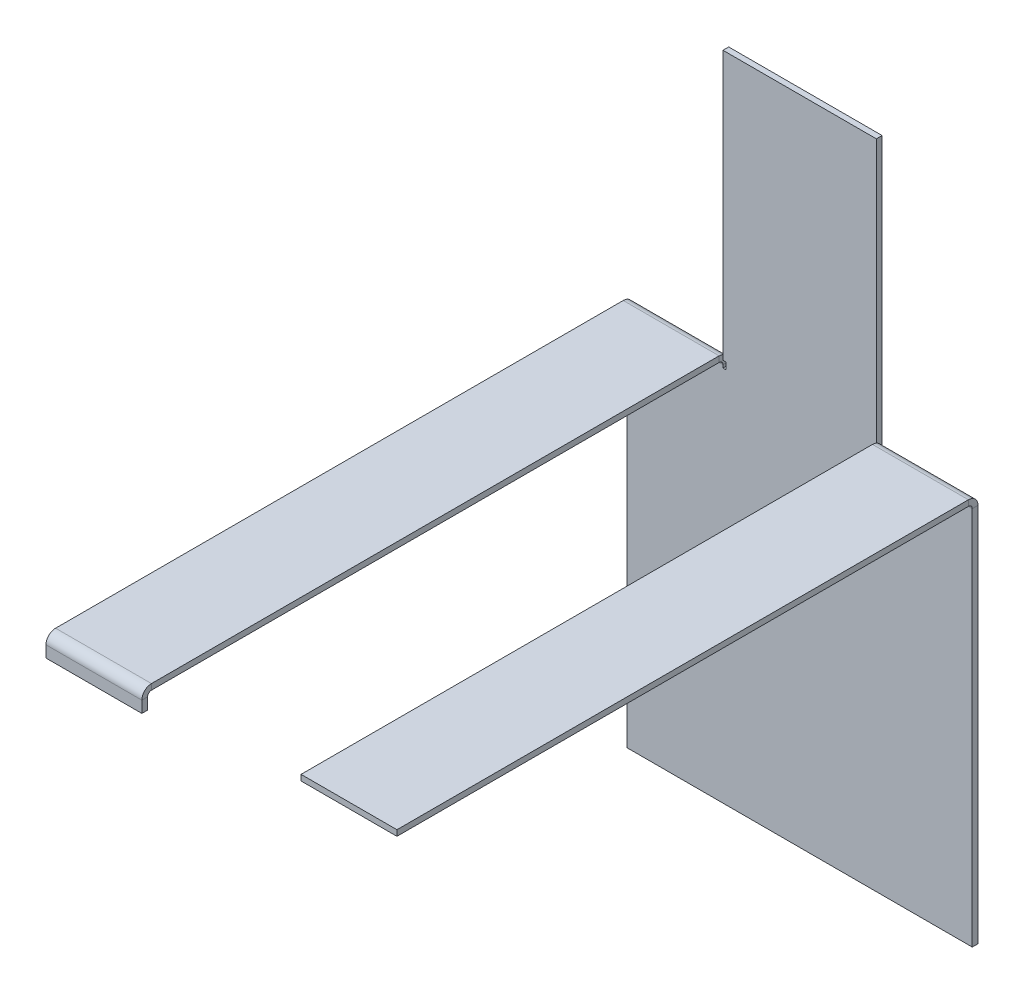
ISO-10303-21;
HEADER;
FILE_DESCRIPTION(('STEP AP214'),'2;1');
FILE_NAME('part.step','',(''),(''),'','','');
FILE_SCHEMA(('AUTOMOTIVE_DESIGN { 1 0 10303 214 1 1 1 1 }'));
ENDSEC;
DATA;
#1=APPLICATION_CONTEXT('core data for automotive mechanical design processes');
#2=APPLICATION_PROTOCOL_DEFINITION('international standard','automotive_design',2000,#1);
#3=PRODUCT_CONTEXT('',#1,'mechanical');
#4=PRODUCT('Part','Part','',(#3));
#5=PRODUCT_RELATED_PRODUCT_CATEGORY('part','',(#4));
#6=PRODUCT_DEFINITION_FORMATION('','',#4);
#7=PRODUCT_DEFINITION_CONTEXT('part definition',#1,'design');
#8=PRODUCT_DEFINITION('design','',#6,#7);
#9=PRODUCT_DEFINITION_SHAPE('','',#8);
#10=(LENGTH_UNIT() NAMED_UNIT(*) SI_UNIT(.MILLI.,.METRE.));
#11=(NAMED_UNIT(*) PLANE_ANGLE_UNIT() SI_UNIT($,.RADIAN.));
#12=(NAMED_UNIT(*) SI_UNIT($,.STERADIAN.) SOLID_ANGLE_UNIT());
#13=UNCERTAINTY_MEASURE_WITH_UNIT(LENGTH_MEASURE(1.E-05),#10,'distance_accuracy_value','');
#14=(GEOMETRIC_REPRESENTATION_CONTEXT(3) GLOBAL_UNCERTAINTY_ASSIGNED_CONTEXT((#13)) GLOBAL_UNIT_ASSIGNED_CONTEXT((#10,
#11,#12)) REPRESENTATION_CONTEXT('',''));
#15=CARTESIAN_POINT('',(0.,0.,0.));
#16=DIRECTION('',(0.,0.,1.));
#17=DIRECTION('',(1.,0.,0.));
#18=AXIS2_PLACEMENT_3D('',#15,#16,#17);
#19=CARTESIAN_POINT('',(-40.,3.,-150.));
#20=DIRECTION('',(-1.,0.,0.));
#21=DIRECTION('',(0.,-1.,0.));
#22=AXIS2_PLACEMENT_3D('',#19,#20,#21);
#23=PLANE('',#22);
#24=DIRECTION('',(0.,1.,0.));
#25=VECTOR('',#24,1.);
#26=CARTESIAN_POINT('',(-40.,1.0547118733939E-12,148.));
#27=LINE('',#26,#25);
#28=CARTESIAN_POINT('',(-40.,1.0547118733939E-12,148.));
#29=VERTEX_POINT('',#28);
#30=CARTESIAN_POINT('',(-40.,3.00000000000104,148.));
#31=VERTEX_POINT('',#30);
#32=EDGE_CURVE('E285',#29,#31,#27,.T.);
#33=ORIENTED_EDGE('',*,*,#32,.F.);
#34=DIRECTION('',(0.,0.,-1.));
#35=VECTOR('',#34,1.);
#36=CARTESIAN_POINT('',(-40.,0.,-150.));
#37=LINE('',#36,#35);
#38=CARTESIAN_POINT('',(-40.,0.,-148.));
#39=VERTEX_POINT('',#38);
#40=EDGE_CURVE('E301',#29,#39,#37,.T.);
#41=ORIENTED_EDGE('',*,*,#40,.T.);
#42=DIRECTION('',(0.,1.,0.));
#43=VECTOR('',#42,1.);
#44=CARTESIAN_POINT('',(-40.,0.,-148.));
#45=LINE('',#44,#43);
#46=CARTESIAN_POINT('',(-40.,3.,-148.));
#47=VERTEX_POINT('',#46);
#48=EDGE_CURVE('E288',#39,#47,#45,.T.);
#49=ORIENTED_EDGE('',*,*,#48,.T.);
#50=DIRECTION('',(0.,0.,-1.));
#51=VECTOR('',#50,1.);
#52=CARTESIAN_POINT('',(-40.,3.,-150.));
#53=LINE('',#52,#51);
#54=EDGE_CURVE('E302',#31,#47,#53,.T.);
#55=ORIENTED_EDGE('',*,*,#54,.F.);
#56=EDGE_LOOP('',(#33,#41,#49,#55));
#57=FACE_BOUND('',#56,.T.);
#58=ADVANCED_FACE('F35',(#57),#23,.F.);
#59=CARTESIAN_POINT('',(-90.,3.00000000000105,150.));
#60=DIRECTION('',(1.,0.,0.));
#61=DIRECTION('',(0.,1.,0.));
#62=AXIS2_PLACEMENT_3D('',#59,#60,#61);
#63=PLANE('',#62);
#64=DIRECTION('',(0.,1.,0.));
#65=VECTOR('',#64,1.);
#66=CARTESIAN_POINT('',(-90.,1.0547118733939E-12,148.));
#67=LINE('',#66,#65);
#68=CARTESIAN_POINT('',(-90.,1.04046143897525E-12,148.));
#69=VERTEX_POINT('',#68);
#70=CARTESIAN_POINT('',(-90.,3.00000000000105,148.));
#71=VERTEX_POINT('',#70);
#72=EDGE_CURVE('E279',#69,#71,#67,.T.);
#73=ORIENTED_EDGE('',*,*,#72,.T.);
#74=DIRECTION('',(0.,0.,1.));
#75=VECTOR('',#74,1.);
#76=CARTESIAN_POINT('',(-90.,3.00000000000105,150.));
#77=LINE('',#76,#75);
#78=CARTESIAN_POINT('',(-90.,3.,-148.));
#79=VERTEX_POINT('',#78);
#80=EDGE_CURVE('E304',#79,#71,#77,.T.);
#81=ORIENTED_EDGE('',*,*,#80,.F.);
#82=DIRECTION('',(0.,1.,0.));
#83=VECTOR('',#82,1.);
#84=CARTESIAN_POINT('',(-90.,0.,-148.));
#85=LINE('',#84,#83);
#86=CARTESIAN_POINT('',(-90.,0.,-148.));
#87=VERTEX_POINT('',#86);
#88=EDGE_CURVE('E293',#87,#79,#85,.T.);
#89=ORIENTED_EDGE('',*,*,#88,.F.);
#90=DIRECTION('',(0.,0.,1.));
#91=VECTOR('',#90,1.);
#92=CARTESIAN_POINT('',(-90.,1.04744440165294E-12,150.));
#93=LINE('',#92,#91);
#94=EDGE_CURVE('E305',#87,#69,#93,.T.);
#95=ORIENTED_EDGE('',*,*,#94,.T.);
#96=EDGE_LOOP('',(#73,#81,#89,#95));
#97=FACE_BOUND('',#96,.T.);
#98=ADVANCED_FACE('F532',(#97),#63,.F.);
#99=CARTESIAN_POINT('',(-40.,3.00000000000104,150.));
#100=DIRECTION('',(0.,-1.,0.));
#101=DIRECTION('',(0.,0.,-1.));
#102=AXIS2_PLACEMENT_3D('',#99,#100,#101);
#103=PLANE('',#102);
#104=DIRECTION('',(-1.,0.,0.));
#105=VECTOR('',#104,1.);
#106=CARTESIAN_POINT('',(-90.,3.00000000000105,148.));
#107=LINE('',#106,#105);
#108=EDGE_CURVE('E232',#71,#31,#107,.F.);
#109=ORIENTED_EDGE('',*,*,#108,.T.);
#110=ORIENTED_EDGE('',*,*,#54,.T.);
#111=DIRECTION('',(1.,0.,0.));
#112=VECTOR('',#111,1.);
#113=CARTESIAN_POINT('',(-40.,3.,-148.));
#114=LINE('',#113,#112);
#115=EDGE_CURVE('E296',#79,#47,#114,.T.);
#116=ORIENTED_EDGE('',*,*,#115,.F.);
#117=ORIENTED_EDGE('',*,*,#80,.T.);
#118=EDGE_LOOP('',(#109,#110,#116,#117));
#119=FACE_BOUND('',#118,.T.);
#120=ADVANCED_FACE('F537',(#119),#103,.F.);
#121=CARTESIAN_POINT('',(-40.,1.04301414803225E-12,150.));
#122=DIRECTION('',(0.,-1.,0.));
#123=DIRECTION('',(0.,0.,-1.));
#124=AXIS2_PLACEMENT_3D('',#121,#122,#123);
#125=PLANE('',#124);
#126=ORIENTED_EDGE('',*,*,#40,.F.);
#127=DIRECTION('',(-1.,0.,0.));
#128=VECTOR('',#127,1.);
#129=CARTESIAN_POINT('',(-90.,1.0547118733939E-12,148.));
#130=LINE('',#129,#128);
#131=EDGE_CURVE('E52',#69,#29,#130,.F.);
#132=ORIENTED_EDGE('',*,*,#131,.F.);
#133=ORIENTED_EDGE('',*,*,#94,.F.);
#134=DIRECTION('',(-1.,0.,0.));
#135=VECTOR('',#134,1.);
#136=CARTESIAN_POINT('',(-40.,0.,-148.));
#137=LINE('',#136,#135);
#138=EDGE_CURVE('E291',#39,#87,#137,.T.);
#139=ORIENTED_EDGE('',*,*,#138,.F.);
#140=EDGE_LOOP('',(#126,#132,#133,#139));
#141=FACE_BOUND('',#140,.T.);
#142=ADVANCED_FACE('F504',(#141),#125,.T.);
#143=CARTESIAN_POINT('',(-90.0000000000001,-200.,-153.));
#144=DIRECTION('',(0.,0.,1.));
#145=DIRECTION('',(1.,0.,0.));
#146=AXIS2_PLACEMENT_3D('',#143,#144,#145);
#147=PLANE('',#146);
#148=DIRECTION('',(-1.,0.,0.));
#149=VECTOR('',#148,1.);
#150=CARTESIAN_POINT('',(-90.,-1.99999999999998,-153.));
#151=LINE('',#150,#149);
#152=CARTESIAN_POINT('',(-90.,-1.99999999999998,-153.));
#153=VERTEX_POINT('',#152);
#154=CARTESIAN_POINT('',(-40.,-1.99999999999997,-153.));
#155=VERTEX_POINT('',#154);
#156=EDGE_CURVE('E310',#153,#155,#151,.F.);
#157=ORIENTED_EDGE('',*,*,#156,.T.);
#158=DIRECTION('',(0.,1.,0.));
#159=VECTOR('',#158,1.);
#160=CARTESIAN_POINT('',(-40.,-200.,-153.));
#161=LINE('',#160,#159);
#162=CARTESIAN_POINT('',(-40.,-3.49999999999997,-153.));
#163=VERTEX_POINT('',#162);
#164=EDGE_CURVE('E359',#163,#155,#161,.T.);
#165=ORIENTED_EDGE('',*,*,#164,.F.);
#166=DIRECTION('',(-1.,0.,0.));
#167=VECTOR('',#166,1.);
#168=CARTESIAN_POINT('',(-90.0000000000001,-3.49999999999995,-153.));
#169=LINE('',#168,#167);
#170=CARTESIAN_POINT('',(-38.5,-3.49999999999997,-153.));
#171=VERTEX_POINT('',#170);
#172=EDGE_CURVE('E357',#171,#163,#169,.T.);
#173=ORIENTED_EDGE('',*,*,#172,.F.);
#174=DIRECTION('',(0.,-1.,0.));
#175=VECTOR('',#174,1.);
#176=CARTESIAN_POINT('',(-38.5,-200.,-153.));
#177=LINE('',#176,#175);
#178=CARTESIAN_POINT('',(-38.5,0.,-153.));
#179=VERTEX_POINT('',#178);
#180=EDGE_CURVE('E355',#179,#171,#177,.T.);
#181=ORIENTED_EDGE('',*,*,#180,.F.);
#182=DIRECTION('',(1.,0.,0.));
#183=VECTOR('',#182,1.);
#184=CARTESIAN_POINT('',(-90.0000000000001,0.,-153.));
#185=LINE('',#184,#183);
#186=CARTESIAN_POINT('',(-40.,0.,-153.));
#187=VERTEX_POINT('',#186);
#188=EDGE_CURVE('E337',#187,#179,#185,.T.);
#189=ORIENTED_EDGE('',*,*,#188,.F.);
#190=DIRECTION('',(0.,-1.,0.));
#191=VECTOR('',#190,1.);
#192=CARTESIAN_POINT('',(-40.,0.,-153.));
#193=LINE('',#192,#191);
#194=CARTESIAN_POINT('',(-40.,140.,-153.));
#195=VERTEX_POINT('',#194);
#196=EDGE_CURVE('E456',#195,#187,#193,.T.);
#197=ORIENTED_EDGE('',*,*,#196,.F.);
#198=DIRECTION('',(-1.,0.,0.));
#199=VECTOR('',#198,1.);
#200=CARTESIAN_POINT('',(-40.,140.,-153.));
#201=LINE('',#200,#199);
#202=CARTESIAN_POINT('',(40.,140.,-153.));
#203=VERTEX_POINT('',#202);
#204=EDGE_CURVE('E453',#203,#195,#201,.T.);
#205=ORIENTED_EDGE('',*,*,#204,.F.);
#206=DIRECTION('',(0.,1.,0.));
#207=VECTOR('',#206,1.);
#208=CARTESIAN_POINT('',(40.,140.,-153.));
#209=LINE('',#208,#207);
#210=CARTESIAN_POINT('',(40.,0.,-153.));
#211=VERTEX_POINT('',#210);
#212=EDGE_CURVE('E450',#211,#203,#209,.T.);
#213=ORIENTED_EDGE('',*,*,#212,.F.);
#214=DIRECTION('',(1.,0.,0.));
#215=VECTOR('',#214,1.);
#216=CARTESIAN_POINT('',(-90.,0.,-153.));
#217=LINE('',#216,#215);
#218=CARTESIAN_POINT('',(38.5,0.,-153.));
#219=VERTEX_POINT('',#218);
#220=EDGE_CURVE('E438',#219,#211,#217,.T.);
#221=ORIENTED_EDGE('',*,*,#220,.F.);
#222=DIRECTION('',(0.,1.,0.));
#223=VECTOR('',#222,1.);
#224=CARTESIAN_POINT('',(38.5,-200.,-153.));
#225=LINE('',#224,#223);
#226=CARTESIAN_POINT('',(38.5,-3.49999999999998,-153.));
#227=VERTEX_POINT('',#226);
#228=EDGE_CURVE('E436',#227,#219,#225,.T.);
#229=ORIENTED_EDGE('',*,*,#228,.F.);
#230=CARTESIAN_POINT('',(39.25,-3.49999999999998,-153.));
#231=DIRECTION('',(0.,0.,1.));
#232=DIRECTION('',(1.,0.,0.));
#233=AXIS2_PLACEMENT_3D('',#230,#231,#232);
#234=CIRCLE('',#233,0.750000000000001);
#235=CARTESIAN_POINT('',(40.,-3.49999999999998,-153.));
#236=VERTEX_POINT('',#235);
#237=EDGE_CURVE('E434',#236,#227,#234,.F.);
#238=ORIENTED_EDGE('',*,*,#237,.F.);
#239=DIRECTION('',(0.,-1.,0.));
#240=VECTOR('',#239,1.);
#241=CARTESIAN_POINT('',(40.,-200.,-153.));
#242=LINE('',#241,#240);
#243=CARTESIAN_POINT('',(40.,-1.99999999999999,-153.));
#244=VERTEX_POINT('',#243);
#245=EDGE_CURVE('E417',#244,#236,#242,.T.);
#246=ORIENTED_EDGE('',*,*,#245,.F.);
#247=DIRECTION('',(-1.,0.,0.));
#248=VECTOR('',#247,1.);
#249=CARTESIAN_POINT('',(40.,-1.99999999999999,-153.));
#250=LINE('',#249,#248);
#251=CARTESIAN_POINT('',(90.,-1.99999999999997,-153.));
#252=VERTEX_POINT('',#251);
#253=EDGE_CURVE('E392',#244,#252,#250,.F.);
#254=ORIENTED_EDGE('',*,*,#253,.T.);
#255=DIRECTION('',(0.,1.,0.));
#256=VECTOR('',#255,1.);
#257=CARTESIAN_POINT('',(90.,0.,-153.));
#258=LINE('',#257,#256);
#259=CARTESIAN_POINT('',(89.9999999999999,-200.,-153.));
#260=VERTEX_POINT('',#259);
#261=EDGE_CURVE('E447',#260,#252,#258,.T.);
#262=ORIENTED_EDGE('',*,*,#261,.F.);
#263=DIRECTION('',(1.,0.,0.));
#264=VECTOR('',#263,1.);
#265=CARTESIAN_POINT('',(-90.0000000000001,-200.,-153.));
#266=LINE('',#265,#264);
#267=CARTESIAN_POINT('',(-90.0000000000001,-200.,-153.));
#268=VERTEX_POINT('',#267);
#269=EDGE_CURVE('E443',#268,#260,#266,.T.);
#270=ORIENTED_EDGE('',*,*,#269,.F.);
#271=DIRECTION('',(0.,-1.,0.));
#272=VECTOR('',#271,1.);
#273=CARTESIAN_POINT('',(-90.,0.,-153.));
#274=LINE('',#273,#272);
#275=EDGE_CURVE('E441',#153,#268,#274,.T.);
#276=ORIENTED_EDGE('',*,*,#275,.F.);
#277=EDGE_LOOP('',(#157,#165,#173,#181,#189,#197,#205,#213,#221,#229,#238,#246,#254,#262,#270,#276));
#278=FACE_BOUND('',#277,.T.);
#279=ADVANCED_FACE('F621',(#278),#147,.F.);
#280=CARTESIAN_POINT('',(-90.0000000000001,-200.,-150.));
#281=DIRECTION('',(0.,0.,1.));
#282=DIRECTION('',(1.,0.,0.));
#283=AXIS2_PLACEMENT_3D('',#280,#281,#282);
#284=PLANE('',#283);
#285=DIRECTION('',(0.,-1.,0.));
#286=VECTOR('',#285,1.);
#287=CARTESIAN_POINT('',(-40.,-1.99999999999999,-150.));
#288=LINE('',#287,#286);
#289=CARTESIAN_POINT('',(-40.,-1.99999999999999,-150.));
#290=VERTEX_POINT('',#289);
#291=CARTESIAN_POINT('',(-40.,-3.49999999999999,-150.));
#292=VERTEX_POINT('',#291);
#293=EDGE_CURVE('E334',#290,#292,#288,.T.);
#294=ORIENTED_EDGE('',*,*,#293,.F.);
#295=DIRECTION('',(-1.,0.,0.));
#296=VECTOR('',#295,1.);
#297=CARTESIAN_POINT('',(-90.,-1.99999999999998,-150.));
#298=LINE('',#297,#296);
#299=CARTESIAN_POINT('',(-90.,-1.99999999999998,-150.));
#300=VERTEX_POINT('',#299);
#301=EDGE_CURVE('E323',#300,#290,#298,.F.);
#302=ORIENTED_EDGE('',*,*,#301,.F.);
#303=DIRECTION('',(0.,-1.,0.));
#304=VECTOR('',#303,1.);
#305=CARTESIAN_POINT('',(-90.,0.,-150.));
#306=LINE('',#305,#304);
#307=CARTESIAN_POINT('',(-90.0000000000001,-200.,-150.));
#308=VERTEX_POINT('',#307);
#309=EDGE_CURVE('E440',#300,#308,#306,.T.);
#310=ORIENTED_EDGE('',*,*,#309,.T.);
#311=DIRECTION('',(1.,0.,0.));
#312=VECTOR('',#311,1.);
#313=CARTESIAN_POINT('',(-90.0000000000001,-200.,-150.));
#314=LINE('',#313,#312);
#315=CARTESIAN_POINT('',(89.9999999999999,-200.,-150.));
#316=VERTEX_POINT('',#315);
#317=EDGE_CURVE('E460',#308,#316,#314,.T.);
#318=ORIENTED_EDGE('',*,*,#317,.T.);
#319=DIRECTION('',(0.,1.,0.));
#320=VECTOR('',#319,1.);
#321=CARTESIAN_POINT('',(90.,0.,-150.));
#322=LINE('',#321,#320);
#323=CARTESIAN_POINT('',(90.,-1.99999999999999,-150.));
#324=VERTEX_POINT('',#323);
#325=EDGE_CURVE('E463',#316,#324,#322,.T.);
#326=ORIENTED_EDGE('',*,*,#325,.T.);
#327=DIRECTION('',(-1.,0.,0.));
#328=VECTOR('',#327,1.);
#329=CARTESIAN_POINT('',(40.,-2.,-150.));
#330=LINE('',#329,#328);
#331=CARTESIAN_POINT('',(40.,-2.,-150.));
#332=VERTEX_POINT('',#331);
#333=EDGE_CURVE('E404',#332,#324,#330,.F.);
#334=ORIENTED_EDGE('',*,*,#333,.F.);
#335=DIRECTION('',(0.,1.,0.));
#336=VECTOR('',#335,1.);
#337=CARTESIAN_POINT('',(40.,-3.5,-150.));
#338=LINE('',#337,#336);
#339=CARTESIAN_POINT('',(40.,-3.5,-150.));
#340=VERTEX_POINT('',#339);
#341=EDGE_CURVE('E60',#340,#332,#338,.T.);
#342=ORIENTED_EDGE('',*,*,#341,.F.);
#343=CARTESIAN_POINT('',(39.25,-3.5,-150.));
#344=DIRECTION('',(0.,0.,1.));
#345=DIRECTION('',(1.,0.,0.));
#346=AXIS2_PLACEMENT_3D('',#343,#344,#345);
#347=CIRCLE('',#346,0.750000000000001);
#348=CARTESIAN_POINT('',(38.5,-3.5,-150.));
#349=VERTEX_POINT('',#348);
#350=EDGE_CURVE('E422',#349,#340,#347,.T.);
#351=ORIENTED_EDGE('',*,*,#350,.F.);
#352=DIRECTION('',(0.,-1.,0.));
#353=VECTOR('',#352,1.);
#354=CARTESIAN_POINT('',(38.5,0.,-150.));
#355=LINE('',#354,#353);
#356=CARTESIAN_POINT('',(38.5,0.,-150.));
#357=VERTEX_POINT('',#356);
#358=EDGE_CURVE('E418',#357,#349,#355,.T.);
#359=ORIENTED_EDGE('',*,*,#358,.F.);
#360=DIRECTION('',(-1.,0.,0.));
#361=VECTOR('',#360,1.);
#362=CARTESIAN_POINT('',(40.,0.,-150.));
#363=LINE('',#362,#361);
#364=CARTESIAN_POINT('',(40.,0.,-150.));
#365=VERTEX_POINT('',#364);
#366=EDGE_CURVE('E414',#365,#357,#363,.T.);
#367=ORIENTED_EDGE('',*,*,#366,.F.);
#368=DIRECTION('',(0.,1.,0.));
#369=VECTOR('',#368,1.);
#370=CARTESIAN_POINT('',(40.,140.,-150.));
#371=LINE('',#370,#369);
#372=CARTESIAN_POINT('',(40.,140.,-150.));
#373=VERTEX_POINT('',#372);
#374=EDGE_CURVE('E466',#365,#373,#371,.T.);
#375=ORIENTED_EDGE('',*,*,#374,.T.);
#376=DIRECTION('',(-1.,0.,0.));
#377=VECTOR('',#376,1.);
#378=CARTESIAN_POINT('',(-40.,140.,-150.));
#379=LINE('',#378,#377);
#380=CARTESIAN_POINT('',(-40.,140.,-150.));
#381=VERTEX_POINT('',#380);
#382=EDGE_CURVE('E469',#373,#381,#379,.T.);
#383=ORIENTED_EDGE('',*,*,#382,.T.);
#384=DIRECTION('',(0.,-1.,0.));
#385=VECTOR('',#384,1.);
#386=CARTESIAN_POINT('',(-40.,0.,-150.));
#387=LINE('',#386,#385);
#388=CARTESIAN_POINT('',(-40.,0.,-150.));
#389=VERTEX_POINT('',#388);
#390=EDGE_CURVE('E444',#381,#389,#387,.T.);
#391=ORIENTED_EDGE('',*,*,#390,.T.);
#392=DIRECTION('',(-1.,0.,0.));
#393=VECTOR('',#392,1.);
#394=CARTESIAN_POINT('',(-38.5,0.,-150.));
#395=LINE('',#394,#393);
#396=CARTESIAN_POINT('',(-38.5,0.,-150.));
#397=VERTEX_POINT('',#396);
#398=EDGE_CURVE('E346',#397,#389,#395,.T.);
#399=ORIENTED_EDGE('',*,*,#398,.F.);
#400=DIRECTION('',(0.,1.,0.));
#401=VECTOR('',#400,1.);
#402=CARTESIAN_POINT('',(-38.5,-3.49999999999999,-150.));
#403=LINE('',#402,#401);
#404=CARTESIAN_POINT('',(-38.5,-3.49999999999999,-150.));
#405=VERTEX_POINT('',#404);
#406=EDGE_CURVE('E342',#405,#397,#403,.T.);
#407=ORIENTED_EDGE('',*,*,#406,.F.);
#408=DIRECTION('',(1.,0.,0.));
#409=VECTOR('',#408,1.);
#410=CARTESIAN_POINT('',(-40.,-3.49999999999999,-150.));
#411=LINE('',#410,#409);
#412=EDGE_CURVE('E338',#292,#405,#411,.T.);
#413=ORIENTED_EDGE('',*,*,#412,.F.);
#414=EDGE_LOOP('',(#294,#302,#310,#318,#326,#334,#342,#351,#359,#367,#375,#383,#391,#399,#407,#413));
#415=FACE_BOUND('',#414,.T.);
#416=ADVANCED_FACE('F491',(#415),#284,.T.);
#417=CARTESIAN_POINT('',(-90.,0.,-153.));
#418=DIRECTION('',(-1.,0.,0.));
#419=DIRECTION('',(0.,-1.,0.));
#420=AXIS2_PLACEMENT_3D('',#417,#418,#419);
#421=PLANE('',#420);
#422=ORIENTED_EDGE('',*,*,#309,.F.);
#423=DIRECTION('',(0.,0.,-1.));
#424=VECTOR('',#423,1.);
#425=CARTESIAN_POINT('',(-90.,-1.99999999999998,-150.));
#426=LINE('',#425,#424);
#427=EDGE_CURVE('E317',#300,#153,#426,.T.);
#428=ORIENTED_EDGE('',*,*,#427,.T.);
#429=ORIENTED_EDGE('',*,*,#275,.T.);
#430=DIRECTION('',(0.,0.,1.));
#431=VECTOR('',#430,1.);
#432=CARTESIAN_POINT('',(-90.0000000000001,-200.,-153.));
#433=LINE('',#432,#431);
#434=EDGE_CURVE('E39',#268,#308,#433,.T.);
#435=ORIENTED_EDGE('',*,*,#434,.T.);
#436=EDGE_LOOP('',(#422,#428,#429,#435));
#437=FACE_BOUND('',#436,.T.);
#438=ADVANCED_FACE('F37',(#437),#421,.T.);
#439=CARTESIAN_POINT('',(-40.,0.,-153.));
#440=DIRECTION('',(-1.,0.,0.));
#441=DIRECTION('',(0.,-1.,0.));
#442=AXIS2_PLACEMENT_3D('',#439,#440,#441);
#443=PLANE('',#442);
#444=ORIENTED_EDGE('',*,*,#390,.F.);
#445=DIRECTION('',(0.,0.,1.));
#446=VECTOR('',#445,1.);
#447=CARTESIAN_POINT('',(-40.,140.,-153.));
#448=LINE('',#447,#446);
#449=EDGE_CURVE('E44',#195,#381,#448,.T.);
#450=ORIENTED_EDGE('',*,*,#449,.F.);
#451=ORIENTED_EDGE('',*,*,#196,.T.);
#452=DIRECTION('',(0.,0.,1.));
#453=VECTOR('',#452,1.);
#454=CARTESIAN_POINT('',(-40.,0.,-153.));
#455=LINE('',#454,#453);
#456=EDGE_CURVE('E11',#187,#389,#455,.T.);
#457=ORIENTED_EDGE('',*,*,#456,.T.);
#458=EDGE_LOOP('',(#444,#450,#451,#457));
#459=FACE_BOUND('',#458,.T.);
#460=ADVANCED_FACE('F627',(#459),#443,.T.);
#461=CARTESIAN_POINT('',(-40.,140.,-153.));
#462=DIRECTION('',(0.,1.,0.));
#463=DIRECTION('',(0.,0.,1.));
#464=AXIS2_PLACEMENT_3D('',#461,#462,#463);
#465=PLANE('',#464);
#466=ORIENTED_EDGE('',*,*,#382,.F.);
#467=DIRECTION('',(0.,0.,1.));
#468=VECTOR('',#467,1.);
#469=CARTESIAN_POINT('',(40.,140.,-153.));
#470=LINE('',#469,#468);
#471=EDGE_CURVE('E475',#203,#373,#470,.T.);
#472=ORIENTED_EDGE('',*,*,#471,.F.);
#473=ORIENTED_EDGE('',*,*,#204,.T.);
#474=ORIENTED_EDGE('',*,*,#449,.T.);
#475=EDGE_LOOP('',(#466,#472,#473,#474));
#476=FACE_BOUND('',#475,.T.);
#477=ADVANCED_FACE('F630',(#476),#465,.T.);
#478=CARTESIAN_POINT('',(40.,140.,-153.));
#479=DIRECTION('',(1.,0.,0.));
#480=DIRECTION('',(0.,1.,0.));
#481=AXIS2_PLACEMENT_3D('',#478,#479,#480);
#482=PLANE('',#481);
#483=ORIENTED_EDGE('',*,*,#374,.F.);
#484=DIRECTION('',(0.,0.,1.));
#485=VECTOR('',#484,1.);
#486=CARTESIAN_POINT('',(40.,0.,-153.));
#487=LINE('',#486,#485);
#488=EDGE_CURVE('E477',#211,#365,#487,.T.);
#489=ORIENTED_EDGE('',*,*,#488,.F.);
#490=ORIENTED_EDGE('',*,*,#212,.T.);
#491=ORIENTED_EDGE('',*,*,#471,.T.);
#492=EDGE_LOOP('',(#483,#489,#490,#491));
#493=FACE_BOUND('',#492,.T.);
#494=ADVANCED_FACE('F634',(#493),#482,.T.);
#495=CARTESIAN_POINT('',(90.,0.,-153.));
#496=DIRECTION('',(1.,0.,0.));
#497=DIRECTION('',(0.,1.,0.));
#498=AXIS2_PLACEMENT_3D('',#495,#496,#497);
#499=PLANE('',#498);
#500=DIRECTION('',(0.,0.,-1.));
#501=VECTOR('',#500,1.);
#502=CARTESIAN_POINT('',(90.,-1.99999999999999,-150.));
#503=LINE('',#502,#501);
#504=EDGE_CURVE('E409',#324,#252,#503,.T.);
#505=ORIENTED_EDGE('',*,*,#504,.F.);
#506=ORIENTED_EDGE('',*,*,#325,.F.);
#507=DIRECTION('',(0.,0.,1.));
#508=VECTOR('',#507,1.);
#509=CARTESIAN_POINT('',(89.9999999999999,-200.,-153.));
#510=LINE('',#509,#508);
#511=EDGE_CURVE('E478',#260,#316,#510,.T.);
#512=ORIENTED_EDGE('',*,*,#511,.F.);
#513=ORIENTED_EDGE('',*,*,#261,.T.);
#514=EDGE_LOOP('',(#505,#506,#512,#513));
#515=FACE_BOUND('',#514,.T.);
#516=ADVANCED_FACE('F638',(#515),#499,.T.);
#517=CARTESIAN_POINT('',(-90.0000000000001,-200.,-153.));
#518=DIRECTION('',(0.,-1.,0.));
#519=DIRECTION('',(0.,0.,-1.));
#520=AXIS2_PLACEMENT_3D('',#517,#518,#519);
#521=PLANE('',#520);
#522=ORIENTED_EDGE('',*,*,#317,.F.);
#523=ORIENTED_EDGE('',*,*,#434,.F.);
#524=ORIENTED_EDGE('',*,*,#269,.T.);
#525=ORIENTED_EDGE('',*,*,#511,.T.);
#526=EDGE_LOOP('',(#522,#523,#524,#525));
#527=FACE_BOUND('',#526,.T.);
#528=ADVANCED_FACE('F488',(#527),#521,.T.);
#529=CARTESIAN_POINT('',(40.,0.,-150.));
#530=DIRECTION('',(0.,-1.,0.));
#531=DIRECTION('',(0.,0.,-1.));
#532=AXIS2_PLACEMENT_3D('',#529,#530,#531);
#533=PLANE('',#532);
#534=DIRECTION('',(0.,0.,-1.));
#535=VECTOR('',#534,1.);
#536=CARTESIAN_POINT('',(38.5,0.,-150.));
#537=LINE('',#536,#535);
#538=EDGE_CURVE('E421',#357,#219,#537,.T.);
#539=ORIENTED_EDGE('',*,*,#538,.T.);
#540=ORIENTED_EDGE('',*,*,#220,.T.);
#541=ORIENTED_EDGE('',*,*,#488,.T.);
#542=ORIENTED_EDGE('',*,*,#366,.T.);
#543=EDGE_LOOP('',(#539,#540,#541,#542));
#544=FACE_BOUND('',#543,.T.);
#545=ADVANCED_FACE('F616',(#544),#533,.T.);
#546=CARTESIAN_POINT('',(38.5,0.,-150.));
#547=DIRECTION('',(1.,0.,0.));
#548=DIRECTION('',(0.,0.,-1.));
#549=AXIS2_PLACEMENT_3D('',#546,#547,#548);
#550=PLANE('',#549);
#551=DIRECTION('',(0.,0.,-1.));
#552=VECTOR('',#551,1.);
#553=CARTESIAN_POINT('',(38.5,-3.5,-150.));
#554=LINE('',#553,#552);
#555=EDGE_CURVE('E425',#349,#227,#554,.T.);
#556=ORIENTED_EDGE('',*,*,#555,.T.);
#557=ORIENTED_EDGE('',*,*,#228,.T.);
#558=ORIENTED_EDGE('',*,*,#538,.F.);
#559=ORIENTED_EDGE('',*,*,#358,.T.);
#560=EDGE_LOOP('',(#556,#557,#558,#559));
#561=FACE_BOUND('',#560,.T.);
#562=ADVANCED_FACE('F612',(#561),#550,.T.);
#563=CARTESIAN_POINT('',(39.25,-3.5,-150.));
#564=DIRECTION('',(0.,0.,-1.));
#565=DIRECTION('',(0.,1.,0.));
#566=AXIS2_PLACEMENT_3D('',#563,#564,#565);
#567=CYLINDRICAL_SURFACE('',#566,0.750000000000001);
#568=DIRECTION('',(0.,0.,-1.));
#569=VECTOR('',#568,1.);
#570=CARTESIAN_POINT('',(40.,-3.5,-150.));
#571=LINE('',#570,#569);
#572=EDGE_CURVE('E412',#340,#236,#571,.T.);
#573=ORIENTED_EDGE('',*,*,#572,.T.);
#574=ORIENTED_EDGE('',*,*,#237,.T.);
#575=ORIENTED_EDGE('',*,*,#555,.F.);
#576=ORIENTED_EDGE('',*,*,#350,.T.);
#577=EDGE_LOOP('',(#573,#574,#575,#576));
#578=FACE_BOUND('',#577,.T.);
#579=ADVANCED_FACE('F609',(#578),#567,.F.);
#580=CARTESIAN_POINT('',(40.,-3.5,-150.));
#581=DIRECTION('',(-1.,0.,0.));
#582=DIRECTION('',(0.,0.,1.));
#583=AXIS2_PLACEMENT_3D('',#580,#581,#582);
#584=PLANE('',#583);
#585=DIRECTION('',(0.,0.,-1.));
#586=VECTOR('',#585,1.);
#587=CARTESIAN_POINT('',(40.,-2.,-150.));
#588=LINE('',#587,#586);
#589=EDGE_CURVE('E398',#332,#244,#588,.T.);
#590=ORIENTED_EDGE('',*,*,#589,.T.);
#591=ORIENTED_EDGE('',*,*,#245,.T.);
#592=ORIENTED_EDGE('',*,*,#572,.F.);
#593=ORIENTED_EDGE('',*,*,#341,.T.);
#594=EDGE_LOOP('',(#590,#591,#592,#593));
#595=FACE_BOUND('',#594,.T.);
#596=ADVANCED_FACE('F602',(#595),#584,.T.);
#597=CARTESIAN_POINT('',(90.,-1.99999999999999,-148.));
#598=DIRECTION('',(1.,0.,0.));
#599=DIRECTION('',(0.,1.,0.));
#600=AXIS2_PLACEMENT_3D('',#597,#598,#599);
#601=PLANE('',#600);
#602=DIRECTION('',(0.,1.,0.));
#603=VECTOR('',#602,1.);
#604=CARTESIAN_POINT('',(90.,0.,-148.));
#605=LINE('',#604,#603);
#606=CARTESIAN_POINT('',(90.,0.,-148.));
#607=VERTEX_POINT('',#606);
#608=CARTESIAN_POINT('',(90.,3.00000000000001,-148.));
#609=VERTEX_POINT('',#608);
#610=EDGE_CURVE('E361',#607,#609,#605,.T.);
#611=ORIENTED_EDGE('',*,*,#610,.F.);
#612=CARTESIAN_POINT('',(90.,-1.99999999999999,-148.));
#613=DIRECTION('',(-1.,0.,0.));
#614=DIRECTION('',(0.,-1.,0.));
#615=AXIS2_PLACEMENT_3D('',#612,#613,#614);
#616=CIRCLE('',#615,2.);
#617=EDGE_CURVE('E401',#324,#607,#616,.F.);
#618=ORIENTED_EDGE('',*,*,#617,.F.);
#619=ORIENTED_EDGE('',*,*,#504,.T.);
#620=CARTESIAN_POINT('',(90.,-1.99999999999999,-148.));
#621=DIRECTION('',(-1.,0.,0.));
#622=DIRECTION('',(0.,-1.,0.));
#623=AXIS2_PLACEMENT_3D('',#620,#621,#622);
#624=CIRCLE('',#623,5.);
#625=EDGE_CURVE('E394',#252,#609,#624,.F.);
#626=ORIENTED_EDGE('',*,*,#625,.T.);
#627=EDGE_LOOP('',(#611,#618,#619,#626));
#628=FACE_BOUND('',#627,.T.);
#629=ADVANCED_FACE('F596',(#628),#601,.T.);
#630=CARTESIAN_POINT('',(40.,-2.,-148.));
#631=DIRECTION('',(1.,0.,0.));
#632=DIRECTION('',(0.,1.,0.));
#633=AXIS2_PLACEMENT_3D('',#630,#631,#632);
#634=PLANE('',#633);
#635=CARTESIAN_POINT('',(40.,-2.,-148.));
#636=DIRECTION('',(-1.,0.,0.));
#637=DIRECTION('',(0.,-1.,0.));
#638=AXIS2_PLACEMENT_3D('',#635,#636,#637);
#639=CIRCLE('',#638,2.);
#640=CARTESIAN_POINT('',(40.,0.,-148.));
#641=VERTEX_POINT('',#640);
#642=EDGE_CURVE('E391',#641,#332,#639,.T.);
#643=ORIENTED_EDGE('',*,*,#642,.F.);
#644=DIRECTION('',(0.,1.,0.));
#645=VECTOR('',#644,1.);
#646=CARTESIAN_POINT('',(40.,0.,-148.));
#647=LINE('',#646,#645);
#648=CARTESIAN_POINT('',(40.,3.,-148.));
#649=VERTEX_POINT('',#648);
#650=EDGE_CURVE('E364',#641,#649,#647,.T.);
#651=ORIENTED_EDGE('',*,*,#650,.T.);
#652=CARTESIAN_POINT('',(40.,-2.,-148.));
#653=DIRECTION('',(-1.,0.,0.));
#654=DIRECTION('',(0.,-1.,0.));
#655=AXIS2_PLACEMENT_3D('',#652,#653,#654);
#656=CIRCLE('',#655,5.);
#657=EDGE_CURVE('E395',#649,#244,#656,.T.);
#658=ORIENTED_EDGE('',*,*,#657,.T.);
#659=ORIENTED_EDGE('',*,*,#589,.F.);
#660=EDGE_LOOP('',(#643,#651,#658,#659));
#661=FACE_BOUND('',#660,.T.);
#662=ADVANCED_FACE('F594',(#661),#634,.F.);
#663=CARTESIAN_POINT('',(40.,-2.,-148.));
#664=DIRECTION('',(-1.,0.,0.));
#665=DIRECTION('',(0.,1.,0.));
#666=AXIS2_PLACEMENT_3D('',#663,#664,#665);
#667=CYLINDRICAL_SURFACE('',#666,5.);
#668=ORIENTED_EDGE('',*,*,#253,.F.);
#669=ORIENTED_EDGE('',*,*,#657,.F.);
#670=DIRECTION('',(1.,0.,0.));
#671=VECTOR('',#670,1.);
#672=CARTESIAN_POINT('',(90.,3.00000000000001,-148.));
#673=LINE('',#672,#671);
#674=EDGE_CURVE('E367',#649,#609,#673,.T.);
#675=ORIENTED_EDGE('',*,*,#674,.T.);
#676=ORIENTED_EDGE('',*,*,#625,.F.);
#677=EDGE_LOOP('',(#668,#669,#675,#676));
#678=FACE_BOUND('',#677,.T.);
#679=ADVANCED_FACE('F591',(#678),#667,.T.);
#680=CARTESIAN_POINT('',(40.,-2.,-148.));
#681=DIRECTION('',(-1.,0.,0.));
#682=DIRECTION('',(0.,1.,0.));
#683=AXIS2_PLACEMENT_3D('',#680,#681,#682);
#684=CYLINDRICAL_SURFACE('',#683,2.);
#685=ORIENTED_EDGE('',*,*,#333,.T.);
#686=ORIENTED_EDGE('',*,*,#617,.T.);
#687=DIRECTION('',(-1.,0.,0.));
#688=VECTOR('',#687,1.);
#689=CARTESIAN_POINT('',(90.,0.,-148.));
#690=LINE('',#689,#688);
#691=EDGE_CURVE('E362',#607,#641,#690,.T.);
#692=ORIENTED_EDGE('',*,*,#691,.T.);
#693=ORIENTED_EDGE('',*,*,#642,.T.);
#694=EDGE_LOOP('',(#685,#686,#692,#693));
#695=FACE_BOUND('',#694,.T.);
#696=ADVANCED_FACE('F589',(#695),#684,.F.);
#697=CARTESIAN_POINT('',(90.,3.,-150.));
#698=DIRECTION('',(-1.,0.,0.));
#699=DIRECTION('',(0.,-1.,0.));
#700=AXIS2_PLACEMENT_3D('',#697,#698,#699);
#701=PLANE('',#700);
#702=ORIENTED_EDGE('',*,*,#610,.T.);
#703=DIRECTION('',(0.,0.,-1.));
#704=VECTOR('',#703,1.);
#705=CARTESIAN_POINT('',(90.,3.,-150.));
#706=LINE('',#705,#704);
#707=CARTESIAN_POINT('',(90.,3.00000000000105,150.));
#708=VERTEX_POINT('',#707);
#709=EDGE_CURVE('E372',#708,#609,#706,.T.);
#710=ORIENTED_EDGE('',*,*,#709,.F.);
#711=DIRECTION('',(0.,-1.,0.));
#712=VECTOR('',#711,1.);
#713=CARTESIAN_POINT('',(90.,3.00000000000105,150.));
#714=LINE('',#713,#712);
#715=CARTESIAN_POINT('',(90.,1.04744440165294E-12,150.));
#716=VERTEX_POINT('',#715);
#717=EDGE_CURVE('E380',#708,#716,#714,.T.);
#718=ORIENTED_EDGE('',*,*,#717,.T.);
#719=DIRECTION('',(0.,0.,-1.));
#720=VECTOR('',#719,1.);
#721=CARTESIAN_POINT('',(90.,0.,-150.));
#722=LINE('',#721,#720);
#723=EDGE_CURVE('E371',#716,#607,#722,.T.);
#724=ORIENTED_EDGE('',*,*,#723,.T.);
#725=EDGE_LOOP('',(#702,#710,#718,#724));
#726=FACE_BOUND('',#725,.T.);
#727=ADVANCED_FACE('F585',(#726),#701,.F.);
#728=CARTESIAN_POINT('',(40.,3.00000000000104,150.));
#729=DIRECTION('',(1.,0.,0.));
#730=DIRECTION('',(0.,1.,0.));
#731=AXIS2_PLACEMENT_3D('',#728,#729,#730);
#732=PLANE('',#731);
#733=ORIENTED_EDGE('',*,*,#650,.F.);
#734=DIRECTION('',(0.,0.,1.));
#735=VECTOR('',#734,1.);
#736=CARTESIAN_POINT('',(40.,1.04301414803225E-12,150.));
#737=LINE('',#736,#735);
#738=CARTESIAN_POINT('',(40.,1.04301414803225E-12,150.));
#739=VERTEX_POINT('',#738);
#740=EDGE_CURVE('E383',#641,#739,#737,.T.);
#741=ORIENTED_EDGE('',*,*,#740,.T.);
#742=DIRECTION('',(0.,-1.,0.));
#743=VECTOR('',#742,1.);
#744=CARTESIAN_POINT('',(40.,3.00000000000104,150.));
#745=LINE('',#744,#743);
#746=CARTESIAN_POINT('',(40.,3.00000000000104,150.));
#747=VERTEX_POINT('',#746);
#748=EDGE_CURVE('E388',#747,#739,#745,.T.);
#749=ORIENTED_EDGE('',*,*,#748,.F.);
#750=DIRECTION('',(0.,0.,1.));
#751=VECTOR('',#750,1.);
#752=CARTESIAN_POINT('',(40.,3.00000000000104,150.));
#753=LINE('',#752,#751);
#754=EDGE_CURVE('E375',#649,#747,#753,.T.);
#755=ORIENTED_EDGE('',*,*,#754,.F.);
#756=EDGE_LOOP('',(#733,#741,#749,#755));
#757=FACE_BOUND('',#756,.T.);
#758=ADVANCED_FACE('F575',(#757),#732,.F.);
#759=CARTESIAN_POINT('',(90.,3.00000000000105,150.));
#760=DIRECTION('',(0.,-1.,0.));
#761=DIRECTION('',(0.,0.,-1.));
#762=AXIS2_PLACEMENT_3D('',#759,#760,#761);
#763=PLANE('',#762);
#764=ORIENTED_EDGE('',*,*,#674,.F.);
#765=ORIENTED_EDGE('',*,*,#754,.T.);
#766=DIRECTION('',(1.,0.,0.));
#767=VECTOR('',#766,1.);
#768=CARTESIAN_POINT('',(90.,3.00000000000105,150.));
#769=LINE('',#768,#767);
#770=EDGE_CURVE('E378',#747,#708,#769,.T.);
#771=ORIENTED_EDGE('',*,*,#770,.T.);
#772=ORIENTED_EDGE('',*,*,#709,.T.);
#773=EDGE_LOOP('',(#764,#765,#771,#772));
#774=FACE_BOUND('',#773,.T.);
#775=ADVANCED_FACE('F571',(#774),#763,.F.);
#776=CARTESIAN_POINT('',(90.,1.04744440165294E-12,150.));
#777=DIRECTION('',(0.,-1.,0.));
#778=DIRECTION('',(0.,0.,-1.));
#779=AXIS2_PLACEMENT_3D('',#776,#777,#778);
#780=PLANE('',#779);
#781=ORIENTED_EDGE('',*,*,#740,.F.);
#782=ORIENTED_EDGE('',*,*,#691,.F.);
#783=ORIENTED_EDGE('',*,*,#723,.F.);
#784=DIRECTION('',(1.,0.,0.));
#785=VECTOR('',#784,1.);
#786=CARTESIAN_POINT('',(90.,1.04744440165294E-12,150.));
#787=LINE('',#786,#785);
#788=EDGE_CURVE('E376',#739,#716,#787,.T.);
#789=ORIENTED_EDGE('',*,*,#788,.F.);
#790=EDGE_LOOP('',(#781,#782,#783,#789));
#791=FACE_BOUND('',#790,.T.);
#792=ADVANCED_FACE('F574',(#791),#780,.T.);
#793=CARTESIAN_POINT('',(90.,3.00000000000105,150.));
#794=DIRECTION('',(0.,0.,-1.));
#795=DIRECTION('',(0.,1.,0.));
#796=AXIS2_PLACEMENT_3D('',#793,#794,#795);
#797=PLANE('',#796);
#798=ORIENTED_EDGE('',*,*,#788,.T.);
#799=ORIENTED_EDGE('',*,*,#717,.F.);
#800=ORIENTED_EDGE('',*,*,#770,.F.);
#801=ORIENTED_EDGE('',*,*,#748,.T.);
#802=EDGE_LOOP('',(#798,#799,#800,#801));
#803=FACE_BOUND('',#802,.T.);
#804=ADVANCED_FACE('F569',(#803),#797,.F.);
#805=CARTESIAN_POINT('',(-40.,-1.99999999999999,-150.));
#806=DIRECTION('',(1.,0.,0.));
#807=DIRECTION('',(0.,0.,-1.));
#808=AXIS2_PLACEMENT_3D('',#805,#806,#807);
#809=PLANE('',#808);
#810=DIRECTION('',(0.,0.,-1.));
#811=VECTOR('',#810,1.);
#812=CARTESIAN_POINT('',(-40.,-3.49999999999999,-150.));
#813=LINE('',#812,#811);
#814=EDGE_CURVE('E341',#292,#163,#813,.T.);
#815=ORIENTED_EDGE('',*,*,#814,.T.);
#816=ORIENTED_EDGE('',*,*,#164,.T.);
#817=DIRECTION('',(0.,0.,-1.));
#818=VECTOR('',#817,1.);
#819=CARTESIAN_POINT('',(-40.,-1.99999999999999,-150.));
#820=LINE('',#819,#818);
#821=EDGE_CURVE('E328',#290,#155,#820,.T.);
#822=ORIENTED_EDGE('',*,*,#821,.F.);
#823=ORIENTED_EDGE('',*,*,#293,.T.);
#824=EDGE_LOOP('',(#815,#816,#822,#823));
#825=FACE_BOUND('',#824,.T.);
#826=ADVANCED_FACE('F565',(#825),#809,.T.);
#827=CARTESIAN_POINT('',(-40.,-3.49999999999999,-150.));
#828=DIRECTION('',(0.,1.,0.));
#829=DIRECTION('',(0.,0.,1.));
#830=AXIS2_PLACEMENT_3D('',#827,#828,#829);
#831=PLANE('',#830);
#832=DIRECTION('',(0.,0.,-1.));
#833=VECTOR('',#832,1.);
#834=CARTESIAN_POINT('',(-38.5,-3.49999999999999,-150.));
#835=LINE('',#834,#833);
#836=EDGE_CURVE('E345',#405,#171,#835,.T.);
#837=ORIENTED_EDGE('',*,*,#836,.T.);
#838=ORIENTED_EDGE('',*,*,#172,.T.);
#839=ORIENTED_EDGE('',*,*,#814,.F.);
#840=ORIENTED_EDGE('',*,*,#412,.T.);
#841=EDGE_LOOP('',(#837,#838,#839,#840));
#842=FACE_BOUND('',#841,.T.);
#843=ADVANCED_FACE('F561',(#842),#831,.T.);
#844=CARTESIAN_POINT('',(-38.5,-3.49999999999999,-150.));
#845=DIRECTION('',(-1.,0.,0.));
#846=DIRECTION('',(0.,0.,1.));
#847=AXIS2_PLACEMENT_3D('',#844,#845,#846);
#848=PLANE('',#847);
#849=DIRECTION('',(0.,0.,-1.));
#850=VECTOR('',#849,1.);
#851=CARTESIAN_POINT('',(-38.5,0.,-150.));
#852=LINE('',#851,#850);
#853=EDGE_CURVE('E331',#397,#179,#852,.T.);
#854=ORIENTED_EDGE('',*,*,#853,.T.);
#855=ORIENTED_EDGE('',*,*,#180,.T.);
#856=ORIENTED_EDGE('',*,*,#836,.F.);
#857=ORIENTED_EDGE('',*,*,#406,.T.);
#858=EDGE_LOOP('',(#854,#855,#856,#857));
#859=FACE_BOUND('',#858,.T.);
#860=ADVANCED_FACE('F557',(#859),#848,.T.);
#861=CARTESIAN_POINT('',(-38.5,0.,-150.));
#862=DIRECTION('',(0.,-1.,0.));
#863=DIRECTION('',(0.,0.,-1.));
#864=AXIS2_PLACEMENT_3D('',#861,#862,#863);
#865=PLANE('',#864);
#866=ORIENTED_EDGE('',*,*,#456,.F.);
#867=ORIENTED_EDGE('',*,*,#188,.T.);
#868=ORIENTED_EDGE('',*,*,#853,.F.);
#869=ORIENTED_EDGE('',*,*,#398,.T.);
#870=EDGE_LOOP('',(#866,#867,#868,#869));
#871=FACE_BOUND('',#870,.T.);
#872=ADVANCED_FACE('F551',(#871),#865,.T.);
#873=CARTESIAN_POINT('',(-40.,-1.99999999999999,-148.));
#874=DIRECTION('',(1.,0.,0.));
#875=DIRECTION('',(0.,1.,0.));
#876=AXIS2_PLACEMENT_3D('',#873,#874,#875);
#877=PLANE('',#876);
#878=ORIENTED_EDGE('',*,*,#48,.F.);
#879=CARTESIAN_POINT('',(-40.,-1.99999999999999,-148.));
#880=DIRECTION('',(-1.,0.,0.));
#881=DIRECTION('',(0.,-1.,0.));
#882=AXIS2_PLACEMENT_3D('',#879,#880,#881);
#883=CIRCLE('',#882,1.99999999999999);
#884=EDGE_CURVE('E320',#290,#39,#883,.F.);
#885=ORIENTED_EDGE('',*,*,#884,.F.);
#886=ORIENTED_EDGE('',*,*,#821,.T.);
#887=CARTESIAN_POINT('',(-40.,-1.99999999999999,-148.));
#888=DIRECTION('',(-1.,0.,0.));
#889=DIRECTION('',(0.,-1.,0.));
#890=AXIS2_PLACEMENT_3D('',#887,#888,#889);
#891=CIRCLE('',#890,4.99999999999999);
#892=EDGE_CURVE('E313',#155,#47,#891,.F.);
#893=ORIENTED_EDGE('',*,*,#892,.T.);
#894=EDGE_LOOP('',(#878,#885,#886,#893));
#895=FACE_BOUND('',#894,.T.);
#896=ADVANCED_FACE('F500',(#895),#877,.T.);
#897=CARTESIAN_POINT('',(-90.,-1.99999999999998,-148.));
#898=DIRECTION('',(1.,0.,0.));
#899=DIRECTION('',(0.,1.,0.));
#900=AXIS2_PLACEMENT_3D('',#897,#898,#899);
#901=PLANE('',#900);
#902=CARTESIAN_POINT('',(-90.,-1.99999999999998,-148.));
#903=DIRECTION('',(-1.,0.,0.));
#904=DIRECTION('',(0.,-1.,0.));
#905=AXIS2_PLACEMENT_3D('',#902,#903,#904);
#906=CIRCLE('',#905,1.99999999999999);
#907=EDGE_CURVE('E307',#87,#300,#906,.T.);
#908=ORIENTED_EDGE('',*,*,#907,.F.);
#909=ORIENTED_EDGE('',*,*,#88,.T.);
#910=CARTESIAN_POINT('',(-90.,-1.99999999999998,-148.));
#911=DIRECTION('',(-1.,0.,0.));
#912=DIRECTION('',(0.,-1.,0.));
#913=AXIS2_PLACEMENT_3D('',#910,#911,#912);
#914=CIRCLE('',#913,4.99999999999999);
#915=EDGE_CURVE('E314',#79,#153,#914,.T.);
#916=ORIENTED_EDGE('',*,*,#915,.T.);
#917=ORIENTED_EDGE('',*,*,#427,.F.);
#918=EDGE_LOOP('',(#908,#909,#916,#917));
#919=FACE_BOUND('',#918,.T.);
#920=ADVANCED_FACE('F545',(#919),#901,.F.);
#921=CARTESIAN_POINT('',(-90.,-1.99999999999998,-148.));
#922=DIRECTION('',(-1.,0.,0.));
#923=DIRECTION('',(0.,1.,0.));
#924=AXIS2_PLACEMENT_3D('',#921,#922,#923);
#925=CYLINDRICAL_SURFACE('',#924,4.99999999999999);
#926=ORIENTED_EDGE('',*,*,#156,.F.);
#927=ORIENTED_EDGE('',*,*,#915,.F.);
#928=ORIENTED_EDGE('',*,*,#115,.T.);
#929=ORIENTED_EDGE('',*,*,#892,.F.);
#930=EDGE_LOOP('',(#926,#927,#928,#929));
#931=FACE_BOUND('',#930,.T.);
#932=ADVANCED_FACE('F542',(#931),#925,.T.);
#933=CARTESIAN_POINT('',(-90.,-1.99999999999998,-148.));
#934=DIRECTION('',(-1.,0.,0.));
#935=DIRECTION('',(0.,1.,0.));
#936=AXIS2_PLACEMENT_3D('',#933,#934,#935);
#937=CYLINDRICAL_SURFACE('',#936,1.99999999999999);
#938=ORIENTED_EDGE('',*,*,#301,.T.);
#939=ORIENTED_EDGE('',*,*,#884,.T.);
#940=ORIENTED_EDGE('',*,*,#138,.T.);
#941=ORIENTED_EDGE('',*,*,#907,.T.);
#942=EDGE_LOOP('',(#938,#939,#940,#941));
#943=FACE_BOUND('',#942,.T.);
#944=ADVANCED_FACE('F495',(#943),#937,.F.);
#945=CARTESIAN_POINT('',(-40.,-1.99999999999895,148.));
#946=DIRECTION('',(1.,0.,0.));
#947=DIRECTION('',(0.,0.,-1.));
#948=AXIS2_PLACEMENT_3D('',#945,#946,#947);
#949=PLANE('',#948);
#950=DIRECTION('',(0.,0.,1.));
#951=VECTOR('',#950,1.);
#952=CARTESIAN_POINT('',(-40.,-1.99999999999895,150.));
#953=LINE('',#952,#951);
#954=CARTESIAN_POINT('',(-40.,-1.99999999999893,150.));
#955=VERTEX_POINT('',#954);
#956=CARTESIAN_POINT('',(-40.,-1.99999999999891,153.));
#957=VERTEX_POINT('',#956);
#958=EDGE_CURVE('E512',#955,#957,#953,.T.);
#959=ORIENTED_EDGE('',*,*,#958,.F.);
#960=CARTESIAN_POINT('',(-40.,-1.99999999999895,148.));
#961=DIRECTION('',(-1.,0.,0.));
#962=DIRECTION('',(0.,0.,1.));
#963=AXIS2_PLACEMENT_3D('',#960,#961,#962);
#964=CIRCLE('',#963,2.);
#965=EDGE_CURVE('E235',#29,#955,#964,.F.);
#966=ORIENTED_EDGE('',*,*,#965,.F.);
#967=ORIENTED_EDGE('',*,*,#32,.T.);
#968=CARTESIAN_POINT('',(-40.,-1.99999999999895,148.));
#969=DIRECTION('',(-1.,0.,0.));
#970=DIRECTION('',(0.,0.,1.));
#971=AXIS2_PLACEMENT_3D('',#968,#969,#970);
#972=CIRCLE('',#971,5.);
#973=EDGE_CURVE('E278',#31,#957,#972,.F.);
#974=ORIENTED_EDGE('',*,*,#973,.T.);
#975=EDGE_LOOP('',(#959,#966,#967,#974));
#976=FACE_BOUND('',#975,.T.);
#977=ADVANCED_FACE('F510',(#976),#949,.T.);
#978=CARTESIAN_POINT('',(-90.,-1.99999999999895,148.));
#979=DIRECTION('',(1.,0.,0.));
#980=DIRECTION('',(0.,0.,-1.));
#981=AXIS2_PLACEMENT_3D('',#978,#979,#980);
#982=PLANE('',#981);
#983=CARTESIAN_POINT('',(-90.,-1.99999999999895,148.));
#984=DIRECTION('',(-1.,0.,0.));
#985=DIRECTION('',(0.,0.,1.));
#986=AXIS2_PLACEMENT_3D('',#983,#984,#985);
#987=CIRCLE('',#986,2.);
#988=CARTESIAN_POINT('',(-90.,-1.99999999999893,150.));
#989=VERTEX_POINT('',#988);
#990=EDGE_CURVE('E242',#989,#69,#987,.T.);
#991=ORIENTED_EDGE('',*,*,#990,.F.);
#992=DIRECTION('',(0.,0.,1.));
#993=VECTOR('',#992,1.);
#994=CARTESIAN_POINT('',(-90.,-1.99999999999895,150.));
#995=LINE('',#994,#993);
#996=CARTESIAN_POINT('',(-90.,-1.99999999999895,153.));
#997=VERTEX_POINT('',#996);
#998=EDGE_CURVE('E239',#989,#997,#995,.T.);
#999=ORIENTED_EDGE('',*,*,#998,.T.);
#1000=CARTESIAN_POINT('',(-90.,-1.99999999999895,148.));
#1001=DIRECTION('',(-1.,0.,0.));
#1002=DIRECTION('',(0.,0.,1.));
#1003=AXIS2_PLACEMENT_3D('',#1000,#1001,#1002);
#1004=CIRCLE('',#1003,5.);
#1005=EDGE_CURVE('E225',#997,#71,#1004,.T.);
#1006=ORIENTED_EDGE('',*,*,#1005,.T.);
#1007=ORIENTED_EDGE('',*,*,#72,.F.);
#1008=EDGE_LOOP('',(#991,#999,#1006,#1007));
#1009=FACE_BOUND('',#1008,.T.);
#1010=ADVANCED_FACE('F240',(#1009),#982,.F.);
#1011=CARTESIAN_POINT('',(-90.,-1.99999999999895,148.));
#1012=DIRECTION('',(-1.,0.,0.));
#1013=DIRECTION('',(0.,0.,1.));
#1014=AXIS2_PLACEMENT_3D('',#1011,#1012,#1013);
#1015=CYLINDRICAL_SURFACE('',#1014,5.);
#1016=ORIENTED_EDGE('',*,*,#108,.F.);
#1017=ORIENTED_EDGE('',*,*,#1005,.F.);
#1018=DIRECTION('',(1.,0.,0.));
#1019=VECTOR('',#1018,1.);
#1020=CARTESIAN_POINT('',(-90.,-1.99999999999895,153.));
#1021=LINE('',#1020,#1019);
#1022=EDGE_CURVE('E230',#997,#957,#1021,.T.);
#1023=ORIENTED_EDGE('',*,*,#1022,.T.);
#1024=ORIENTED_EDGE('',*,*,#973,.F.);
#1025=EDGE_LOOP('',(#1016,#1017,#1023,#1024));
#1026=FACE_BOUND('',#1025,.T.);
#1027=ADVANCED_FACE('F227',(#1026),#1015,.T.);
#1028=CARTESIAN_POINT('',(-90.,-1.99999999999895,148.));
#1029=DIRECTION('',(-1.,0.,0.));
#1030=DIRECTION('',(0.,0.,1.));
#1031=AXIS2_PLACEMENT_3D('',#1028,#1029,#1030);
#1032=CYLINDRICAL_SURFACE('',#1031,2.);
#1033=ORIENTED_EDGE('',*,*,#131,.T.);
#1034=ORIENTED_EDGE('',*,*,#965,.T.);
#1035=DIRECTION('',(-1.,0.,0.));
#1036=VECTOR('',#1035,1.);
#1037=CARTESIAN_POINT('',(-40.,-1.99999999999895,150.));
#1038=LINE('',#1037,#1036);
#1039=EDGE_CURVE('E246',#955,#989,#1038,.T.);
#1040=ORIENTED_EDGE('',*,*,#1039,.T.);
#1041=ORIENTED_EDGE('',*,*,#990,.T.);
#1042=EDGE_LOOP('',(#1033,#1034,#1040,#1041));
#1043=FACE_BOUND('',#1042,.T.);
#1044=ADVANCED_FACE('F507',(#1043),#1032,.F.);
#1045=CARTESIAN_POINT('',(-90.,-7.99999999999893,153.));
#1046=DIRECTION('',(1.,0.,0.));
#1047=DIRECTION('',(0.,0.,-1.));
#1048=AXIS2_PLACEMENT_3D('',#1045,#1046,#1047);
#1049=PLANE('',#1048);
#1050=ORIENTED_EDGE('',*,*,#998,.F.);
#1051=DIRECTION('',(0.,-1.,0.));
#1052=VECTOR('',#1051,1.);
#1053=CARTESIAN_POINT('',(-90.,-7.99999999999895,150.));
#1054=LINE('',#1053,#1052);
#1055=CARTESIAN_POINT('',(-90.,-7.99999999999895,150.));
#1056=VERTEX_POINT('',#1055);
#1057=EDGE_CURVE('E255',#989,#1056,#1054,.T.);
#1058=ORIENTED_EDGE('',*,*,#1057,.T.);
#1059=DIRECTION('',(0.,0.,-1.));
#1060=VECTOR('',#1059,1.);
#1061=CARTESIAN_POINT('',(-90.,-7.99999999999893,153.));
#1062=LINE('',#1061,#1060);
#1063=CARTESIAN_POINT('',(-90.,-7.99999999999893,153.));
#1064=VERTEX_POINT('',#1063);
#1065=EDGE_CURVE('E260',#1064,#1056,#1062,.T.);
#1066=ORIENTED_EDGE('',*,*,#1065,.F.);
#1067=DIRECTION('',(0.,-1.,0.));
#1068=VECTOR('',#1067,1.);
#1069=CARTESIAN_POINT('',(-90.,-7.99999999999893,153.));
#1070=LINE('',#1069,#1068);
#1071=EDGE_CURVE('E251',#997,#1064,#1070,.T.);
#1072=ORIENTED_EDGE('',*,*,#1071,.F.);
#1073=EDGE_LOOP('',(#1050,#1058,#1066,#1072));
#1074=FACE_BOUND('',#1073,.T.);
#1075=ADVANCED_FACE('F258',(#1074),#1049,.F.);
#1076=CARTESIAN_POINT('',(-40.,1.06396303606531E-12,153.));
#1077=DIRECTION('',(-1.,0.,0.));
#1078=DIRECTION('',(0.,0.,1.));
#1079=AXIS2_PLACEMENT_3D('',#1076,#1077,#1078);
#1080=PLANE('',#1079);
#1081=ORIENTED_EDGE('',*,*,#958,.T.);
#1082=DIRECTION('',(0.,1.,0.));
#1083=VECTOR('',#1082,1.);
#1084=CARTESIAN_POINT('',(-40.,1.06396303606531E-12,153.));
#1085=LINE('',#1084,#1083);
#1086=CARTESIAN_POINT('',(-40.,-7.99999999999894,153.));
#1087=VERTEX_POINT('',#1086);
#1088=EDGE_CURVE('E254',#1087,#957,#1085,.T.);
#1089=ORIENTED_EDGE('',*,*,#1088,.F.);
#1090=DIRECTION('',(0.,0.,-1.));
#1091=VECTOR('',#1090,1.);
#1092=CARTESIAN_POINT('',(-40.,-7.99999999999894,153.));
#1093=LINE('',#1092,#1091);
#1094=CARTESIAN_POINT('',(-40.,-7.99999999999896,150.));
#1095=VERTEX_POINT('',#1094);
#1096=EDGE_CURVE('E271',#1087,#1095,#1093,.T.);
#1097=ORIENTED_EDGE('',*,*,#1096,.T.);
#1098=DIRECTION('',(0.,1.,0.));
#1099=VECTOR('',#1098,1.);
#1100=CARTESIAN_POINT('',(-40.,1.04301414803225E-12,150.));
#1101=LINE('',#1100,#1099);
#1102=EDGE_CURVE('E262',#1095,#955,#1101,.T.);
#1103=ORIENTED_EDGE('',*,*,#1102,.T.);
#1104=EDGE_LOOP('',(#1081,#1089,#1097,#1103));
#1105=FACE_BOUND('',#1104,.T.);
#1106=ADVANCED_FACE('F519',(#1105),#1080,.F.);
#1107=CARTESIAN_POINT('',(-90.,1.068393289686E-12,153.));
#1108=DIRECTION('',(0.,0.,-1.));
#1109=DIRECTION('',(0.,1.,0.));
#1110=AXIS2_PLACEMENT_3D('',#1107,#1108,#1109);
#1111=PLANE('',#1110);
#1112=ORIENTED_EDGE('',*,*,#1022,.F.);
#1113=ORIENTED_EDGE('',*,*,#1071,.T.);
#1114=DIRECTION('',(1.,0.,0.));
#1115=VECTOR('',#1114,1.);
#1116=CARTESIAN_POINT('',(-40.,-7.99999999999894,153.));
#1117=LINE('',#1116,#1115);
#1118=EDGE_CURVE('E261',#1064,#1087,#1117,.T.);
#1119=ORIENTED_EDGE('',*,*,#1118,.T.);
#1120=ORIENTED_EDGE('',*,*,#1088,.T.);
#1121=EDGE_LOOP('',(#1112,#1113,#1119,#1120));
#1122=FACE_BOUND('',#1121,.T.);
#1123=ADVANCED_FACE('F250',(#1122),#1111,.F.);
#1124=CARTESIAN_POINT('',(-90.,1.04744440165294E-12,150.));
#1125=DIRECTION('',(0.,0.,-1.));
#1126=DIRECTION('',(0.,1.,0.));
#1127=AXIS2_PLACEMENT_3D('',#1124,#1125,#1126);
#1128=PLANE('',#1127);
#1129=ORIENTED_EDGE('',*,*,#1057,.F.);
#1130=ORIENTED_EDGE('',*,*,#1039,.F.);
#1131=ORIENTED_EDGE('',*,*,#1102,.F.);
#1132=DIRECTION('',(1.,0.,0.));
#1133=VECTOR('',#1132,1.);
#1134=CARTESIAN_POINT('',(-40.,-7.99999999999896,150.));
#1135=LINE('',#1134,#1133);
#1136=EDGE_CURVE('E266',#1056,#1095,#1135,.T.);
#1137=ORIENTED_EDGE('',*,*,#1136,.F.);
#1138=EDGE_LOOP('',(#1129,#1130,#1131,#1137));
#1139=FACE_BOUND('',#1138,.T.);
#1140=ADVANCED_FACE('F517',(#1139),#1128,.T.);
#1141=CARTESIAN_POINT('',(-40.,-7.99999999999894,153.));
#1142=DIRECTION('',(0.,1.,0.));
#1143=DIRECTION('',(0.,0.,1.));
#1144=AXIS2_PLACEMENT_3D('',#1141,#1142,#1143);
#1145=PLANE('',#1144);
#1146=ORIENTED_EDGE('',*,*,#1136,.T.);
#1147=ORIENTED_EDGE('',*,*,#1096,.F.);
#1148=ORIENTED_EDGE('',*,*,#1118,.F.);
#1149=ORIENTED_EDGE('',*,*,#1065,.T.);
#1150=EDGE_LOOP('',(#1146,#1147,#1148,#1149));
#1151=FACE_BOUND('',#1150,.T.);
#1152=ADVANCED_FACE('F522',(#1151),#1145,.F.);
#1153=CLOSED_SHELL('',(#58,#98,#120,#142,#279,#416,#438,#460,#477,#494,#516,#528,#545,#562,#579,
#596,#629,#662,#679,#696,#727,#758,#775,#792,#804,#826,#843,#860,#872,#896,#920,#932,#944,#977,
#1010,#1027,#1044,#1075,#1106,#1123,#1140,#1152));
#1154=MANIFOLD_SOLID_BREP('B2',#1153);
#1155=ADVANCED_BREP_SHAPE_REPRESENTATION('',(#18,#1154),#14);
#1156=SHAPE_DEFINITION_REPRESENTATION(#9,#1155);
ENDSEC;
END-ISO-10303-21;
